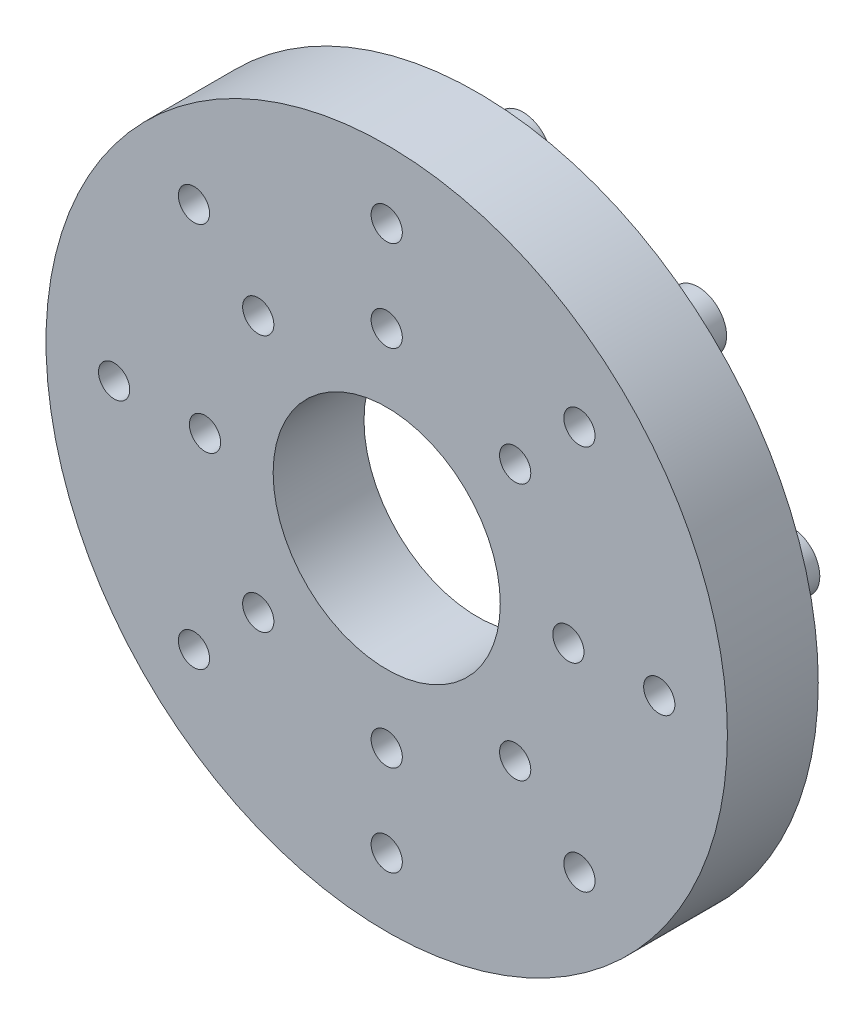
from build123d import *

# Parameters (mm, degrees)
SKETCH2_R                   = 190.5
SKETCH2_R_2                 = 63.5
BOSS_EXTRUDE1_DEPTH         = 25.4
SKETCH3_R                   = 15.875
BOSS_EXTRUDE2_DEPTH         = 25.4
F_3_4_16_TAPPED_HOLE1_D     = 17.4625
F_3_4_16_TAPPED_HOLE1_DEPTH = 42.926
F_3_4_16_TAPPED_HOLE1_TIP   = 5.24626428


with BuildPart() as part:
    # Sketch2 → Boss-Extrude1 (new, symmetric)
    with BuildSketch(Plane.XY):
        Circle(SKETCH2_R)
        Circle(SKETCH2_R_2, mode=Mode.SUBTRACT)
    extrude(amount=BOSS_EXTRUDE1_DEPTH, both=True)

    # Sketch3 → Boss-Extrude2 (add)
    with BuildSketch(Plane(origin=(0, 0, -25.4), x_dir=(-1, 0, 0), z_dir=(0, 0, -1))):
        with Locations(Location((0, 152.4, 0), (0, 0, 180))):
            Circle(SKETCH3_R)
        with Locations(Location((97.960831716, 116.745173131, 0), (0, 0, 180))):
            Circle(SKETCH3_R)
        with Locations(Location((150.084701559, 26.463982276, 0), (0, 0, 180))):
            Circle(SKETCH3_R)
        with Locations(Location((131.982271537, -76.2, 0), (0, 0, 180))):
            Circle(SKETCH3_R)
        with Locations(Location((52.123869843, -143.209155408, 0), (0, 0, 180))):
            Circle(SKETCH3_R)
        with Locations(Location((-52.123869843, -143.209155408, 0), (0, 0, 180))):
            Circle(SKETCH3_R)
        with Locations(Location((-131.982271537, -76.2, 0), (0, 0, 180))):
            Circle(SKETCH3_R)
        with Locations(Location((-150.084701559, 26.463982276, 0), (0, 0, 180))):
            Circle(SKETCH3_R)
        with Locations(Location((-97.960831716, 116.745173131, 0), (0, 0, 180))):
            Circle(SKETCH3_R)
    extrude(amount=BOSS_EXTRUDE2_DEPTH)

    # 3_4-16 Tapped Hole1
    with Locations(Plane.XY.offset(25.4)):
        with Locations((0, 101.5873), (0, 152.4), (107.763073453, 107.763073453), (71.833068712, 71.833068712), (101.5873, 0), (152.4, 0), (71.833068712, -71.833068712), (107.763073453, -107.763073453), (0, -101.5873), (0, -152.4), (-107.763073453, -107.763073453), (-71.833068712, -71.833068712), (-152.4, 0), (-101.5873, 0), (-71.833068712, 71.833068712), (-107.763073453, 107.763073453)):
            Hole(F_3_4_16_TAPPED_HOLE1_D / 2, depth=F_3_4_16_TAPPED_HOLE1_DEPTH)
            with Locations((0, 0, -(F_3_4_16_TAPPED_HOLE1_DEPTH + F_3_4_16_TAPPED_HOLE1_TIP / 2))):  # 118° drill point
                Cone(0, F_3_4_16_TAPPED_HOLE1_D / 2, F_3_4_16_TAPPED_HOLE1_TIP, mode=Mode.SUBTRACT)


solid = part.part
